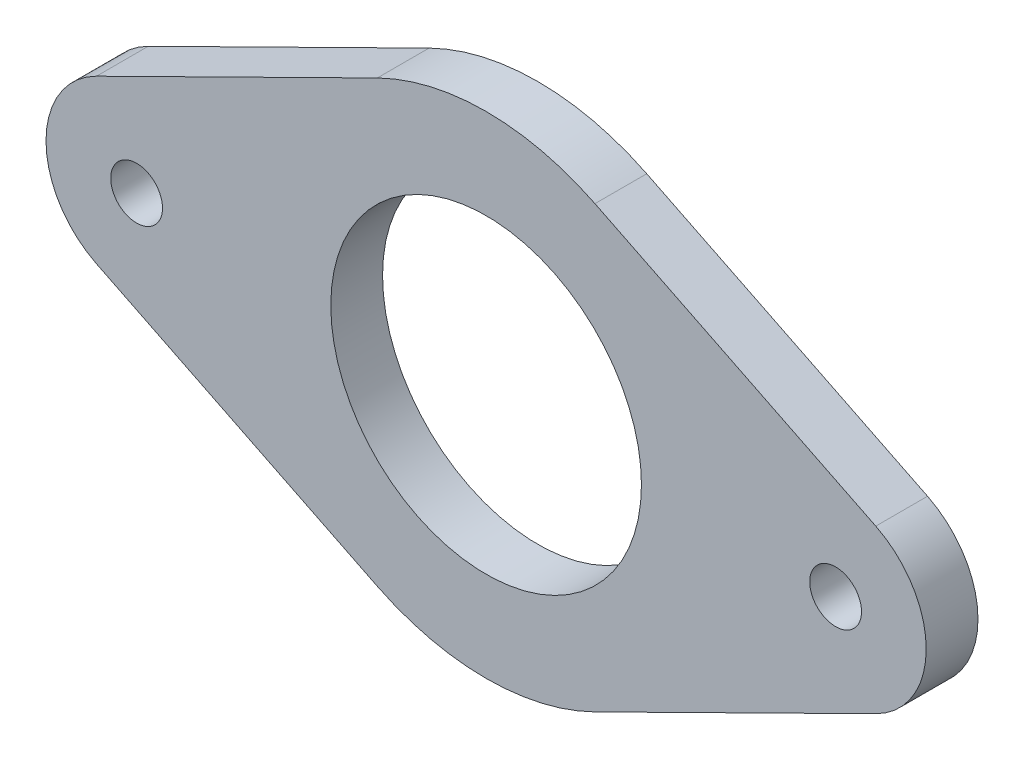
from build123d import *

# Parameters (mm, degrees)
ESQUISSE1_R          = 12
ESQUISSE1_R_2        = 2
BASE_EXTRUSION_DEPTH = 4


with BuildPart() as part:
    # Esquisse1 → Base-Extrusion (new body)
    with BuildSketch(Plane.XY):
        with BuildLine():
            Line((-30.102764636, 6.274779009), (-8.407519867, 17.002684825))
            ThreePointArc((-8.407519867, 17.002684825), (0, 18.967806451), (8.407519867, 17.002684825))
            Line((8.407519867, 17.002684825), (30.102764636, 6.274779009))
            ThreePointArc((30.102764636, 6.274779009), (34, 0), (30.102764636, -6.274779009))
            Line((30.102764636, -6.274779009), (8.407519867, -17.002684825))
            ThreePointArc((8.407519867, -17.002684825), (0, -18.967806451), (-8.407519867, -17.002684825))
            Line((-8.407519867, -17.002684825), (-30.102764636, -6.274779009))
            ThreePointArc((-30.102764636, -6.274779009), (-34, 0), (-30.102764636, 6.274779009))
        make_face()
        Circle(ESQUISSE1_R, mode=Mode.SUBTRACT)
        with Locations((-27, 0)):
            Circle(ESQUISSE1_R_2, mode=Mode.SUBTRACT)
        with Locations((27, 0)):
            Circle(ESQUISSE1_R_2, mode=Mode.SUBTRACT)
    extrude(amount=BASE_EXTRUSION_DEPTH)


solid = part.part
